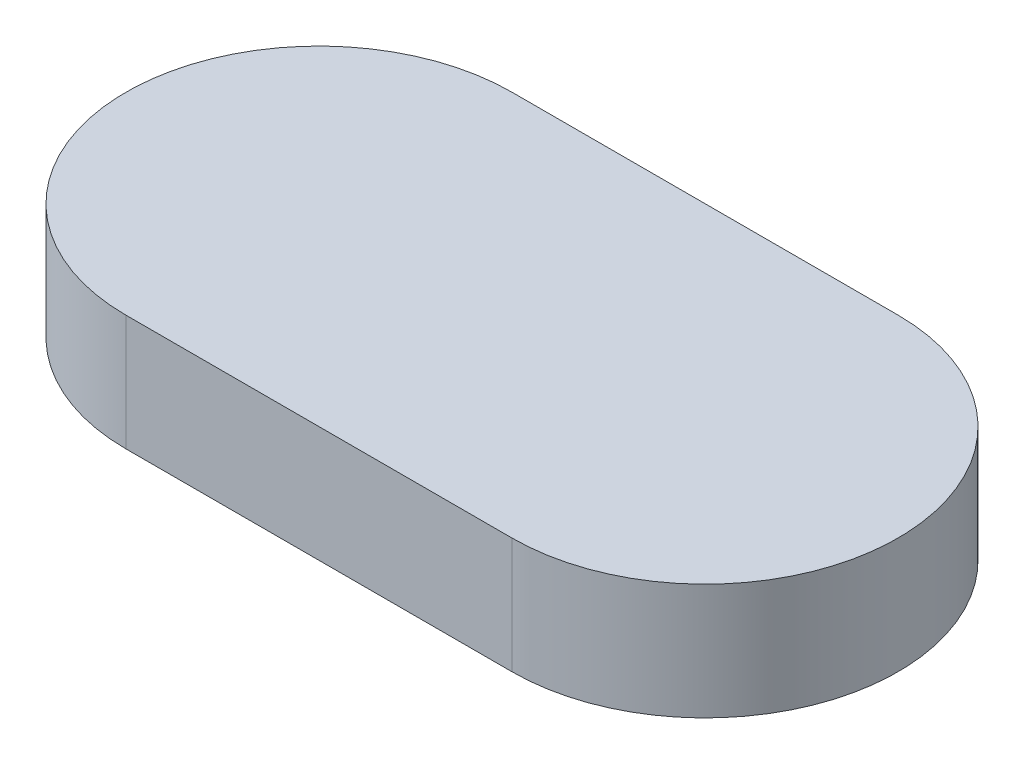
from build123d import *

# Parameters (mm, degrees)
SKETCH1_W      = 100
SKETCH1_H      = 50
EXTRUDE1_DEPTH = 15
FILLET1_RADIUS = 25
FILLET1_LENGTH = 15
FILLET2_RADIUS = 25
FILLET2_LENGTH = 15


with BuildPart() as part:
    # Sketch1 → Extrude1 (new body)
    with BuildSketch(Plane(origin=(0, 0, 0), x_dir=(1, 0, 0), z_dir=(0, 1, 0))):
        Rectangle(SKETCH1_W, SKETCH1_H)
    extrude(amount=EXTRUDE1_DEPTH)

    # Fillet1: full round fillet: the end face becomes a half cylinder, R = half its width
    fillet1_face = Plane((50, 7.5, 0), x_dir=(0, 1, 0), z_dir=(1, 0, 0))  # on the end face: x along it, z out of the body
    fillet1_slab = fillet1_face.offset(-FILLET1_RADIUS / 2) * Box(FILLET1_LENGTH, 2 * FILLET1_RADIUS, FILLET1_RADIUS, mode=Mode.PRIVATE)  # the body's end, R deep
    fillet1_round = Plane((25, 7.5, 0), x_dir=(1, 0, 0), z_dir=(0, 1, 0)) * Cylinder(FILLET1_RADIUS, FILLET1_LENGTH, mode=Mode.PRIVATE)  # its axis R under the face
    add(fillet1_slab - fillet1_round, mode=Mode.SUBTRACT)

    # Fillet2: full round fillet: the end face becomes a half cylinder, R = half its width
    fillet2_face = Plane((-50, 7.5, 0), x_dir=(0, -1, 0), z_dir=(-1, 0, 0))  # on the end face: x along it, z out of the body
    fillet2_slab = fillet2_face.offset(-FILLET2_RADIUS / 2) * Box(FILLET2_LENGTH, 2 * FILLET2_RADIUS, FILLET2_RADIUS, mode=Mode.PRIVATE)  # the body's end, R deep
    fillet2_round = Plane((-25, 7.5, 0), x_dir=(-1, 0, 0), z_dir=(0, -1, 0)) * Cylinder(FILLET2_RADIUS, FILLET2_LENGTH, mode=Mode.PRIVATE)  # its axis R under the face
    add(fillet2_slab - fillet2_round, mode=Mode.SUBTRACT)


solid = part.part
